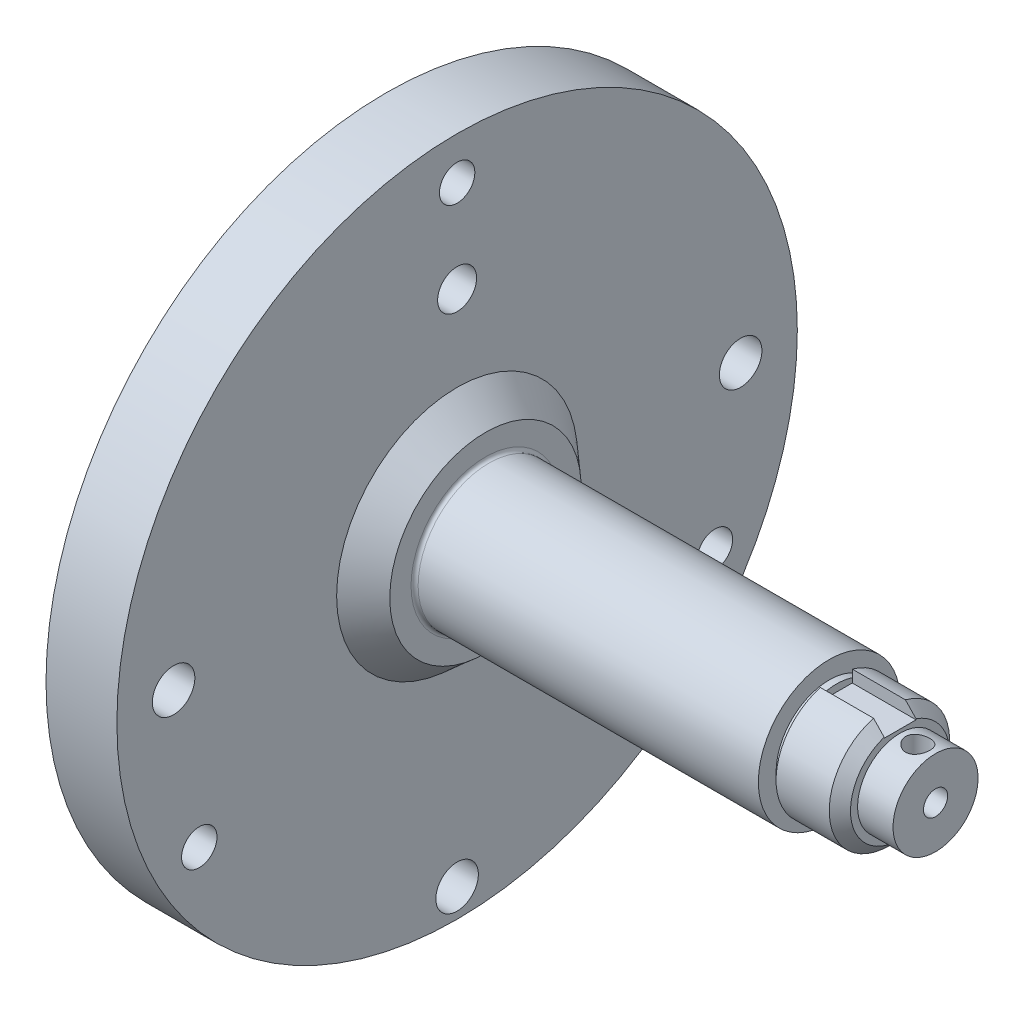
ISO-10303-21;
HEADER;
FILE_DESCRIPTION(('STEP AP214'),'2;1');
FILE_NAME('part.step','',(''),(''),'','','');
FILE_SCHEMA(('AUTOMOTIVE_DESIGN { 1 0 10303 214 1 1 1 1 }'));
ENDSEC;
DATA;
#1=APPLICATION_CONTEXT('core data for automotive mechanical design processes');
#2=APPLICATION_PROTOCOL_DEFINITION('international standard','automotive_design',2000,#1);
#3=PRODUCT_CONTEXT('',#1,'mechanical');
#4=PRODUCT('Part','Part','',(#3));
#5=PRODUCT_RELATED_PRODUCT_CATEGORY('part','',(#4));
#6=PRODUCT_DEFINITION_FORMATION('','',#4);
#7=PRODUCT_DEFINITION_CONTEXT('part definition',#1,'design');
#8=PRODUCT_DEFINITION('design','',#6,#7);
#9=PRODUCT_DEFINITION_SHAPE('','',#8);
#10=(LENGTH_UNIT() NAMED_UNIT(*) SI_UNIT(.MILLI.,.METRE.));
#11=(NAMED_UNIT(*) PLANE_ANGLE_UNIT() SI_UNIT($,.RADIAN.));
#12=(NAMED_UNIT(*) SI_UNIT($,.STERADIAN.) SOLID_ANGLE_UNIT());
#13=UNCERTAINTY_MEASURE_WITH_UNIT(LENGTH_MEASURE(1.E-05),#10,'distance_accuracy_value','');
#14=(GEOMETRIC_REPRESENTATION_CONTEXT(3) GLOBAL_UNCERTAINTY_ASSIGNED_CONTEXT((#13)) GLOBAL_UNIT_ASSIGNED_CONTEXT((#10,
#11,#12)) REPRESENTATION_CONTEXT('',''));
#15=CARTESIAN_POINT('',(0.,0.,0.));
#16=DIRECTION('',(0.,0.,1.));
#17=DIRECTION('',(1.,0.,0.));
#18=AXIS2_PLACEMENT_3D('',#15,#16,#17);
#19=CARTESIAN_POINT('',(0.,0.,0.));
#20=DIRECTION('',(-1.,0.,0.));
#21=DIRECTION('',(0.,0.,1.));
#22=AXIS2_PLACEMENT_3D('',#19,#20,#21);
#23=PLANE('',#22);
#24=CARTESIAN_POINT('',(0.,29.,0.));
#25=DIRECTION('',(-1.,0.,0.));
#26=DIRECTION('',(0.,0.,1.));
#27=AXIS2_PLACEMENT_3D('',#24,#25,#26);
#28=CIRCLE('',#27,2.75);
#29=CARTESIAN_POINT('',(0.,29.,2.75));
#30=VERTEX_POINT('',#29);
#31=EDGE_CURVE('E113',#30,#30,#28,.T.);
#32=ORIENTED_EDGE('',*,*,#31,.F.);
#33=EDGE_LOOP('',(#32));
#34=FACE_BOUND('',#33,.T.);
#35=CARTESIAN_POINT('',(0.,0.,0.));
#36=DIRECTION('',(-1.,0.,0.));
#37=DIRECTION('',(0.,0.,1.));
#38=AXIS2_PLACEMENT_3D('',#35,#36,#37);
#39=CIRCLE('',#38,35.);
#40=CARTESIAN_POINT('',(0.,0.,35.));
#41=VERTEX_POINT('',#40);
#42=EDGE_CURVE('E197',#41,#41,#39,.T.);
#43=ORIENTED_EDGE('',*,*,#42,.T.);
#44=EDGE_LOOP('',(#43));
#45=FACE_BOUND('',#44,.T.);
#46=ADVANCED_FACE('F33',(#34,#45),#23,.T.);
#47=CARTESIAN_POINT('',(-50.8434878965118,0.,0.));
#48=DIRECTION('',(-1.,0.,0.));
#49=DIRECTION('',(0.,0.,1.));
#50=AXIS2_PLACEMENT_3D('',#47,#48,#49);
#51=CYLINDRICAL_SURFACE('',#50,35.);
#52=CARTESIAN_POINT('',(-1.49999999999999,0.,0.));
#53=DIRECTION('',(-1.,0.,0.));
#54=DIRECTION('',(0.,0.,1.));
#55=AXIS2_PLACEMENT_3D('',#52,#53,#54);
#56=CIRCLE('',#55,35.);
#57=CARTESIAN_POINT('',(-1.49999999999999,0.,35.));
#58=VERTEX_POINT('',#57);
#59=EDGE_CURVE('E199',#58,#58,#56,.T.);
#60=ORIENTED_EDGE('',*,*,#59,.T.);
#61=EDGE_LOOP('',(#60));
#62=FACE_BOUND('',#61,.T.);
#63=ORIENTED_EDGE('',*,*,#42,.F.);
#64=EDGE_LOOP('',(#63));
#65=FACE_BOUND('',#64,.T.);
#66=ADVANCED_FACE('F186',(#62,#65),#51,.F.);
#67=CARTESIAN_POINT('',(-1.5,-48.,0.));
#68=DIRECTION('',(-1.,0.,0.));
#69=DIRECTION('',(0.,0.,1.));
#70=AXIS2_PLACEMENT_3D('',#67,#68,#69);
#71=PLANE('',#70);
#72=CARTESIAN_POINT('',(-1.5,42.,0.));
#73=DIRECTION('',(-1.,0.,0.));
#74=DIRECTION('',(0.,0.,1.));
#75=AXIS2_PLACEMENT_3D('',#72,#73,#74);
#76=CIRCLE('',#75,2.49999999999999);
#77=CARTESIAN_POINT('',(-1.5,42.,2.49999999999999));
#78=VERTEX_POINT('',#77);
#79=EDGE_CURVE('E165',#78,#78,#76,.T.);
#80=ORIENTED_EDGE('',*,*,#79,.F.);
#81=EDGE_LOOP('',(#80));
#82=FACE_BOUND('',#81,.T.);
#83=CARTESIAN_POINT('',(-1.5,-20.9999999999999,-36.3730669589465));
#84=DIRECTION('',(-1.,0.,0.));
#85=DIRECTION('',(0.,0.,1.));
#86=AXIS2_PLACEMENT_3D('',#83,#84,#85);
#87=CIRCLE('',#86,2.49999999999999);
#88=CARTESIAN_POINT('',(-1.5,-20.9999999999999,-33.8730669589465));
#89=VERTEX_POINT('',#88);
#90=EDGE_CURVE('E226',#89,#89,#87,.T.);
#91=ORIENTED_EDGE('',*,*,#90,.F.);
#92=EDGE_LOOP('',(#91));
#93=FACE_BOUND('',#92,.T.);
#94=CARTESIAN_POINT('',(-1.5,-20.9999999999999,36.3730669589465));
#95=DIRECTION('',(-1.,0.,0.));
#96=DIRECTION('',(0.,0.,1.));
#97=AXIS2_PLACEMENT_3D('',#94,#95,#96);
#98=CIRCLE('',#97,2.49999999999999);
#99=CARTESIAN_POINT('',(-1.5,-20.9999999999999,38.8730669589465));
#100=VERTEX_POINT('',#99);
#101=EDGE_CURVE('E222',#100,#100,#98,.T.);
#102=ORIENTED_EDGE('',*,*,#101,.F.);
#103=EDGE_LOOP('',(#102));
#104=FACE_BOUND('',#103,.T.);
#105=CARTESIAN_POINT('',(-1.5,-44.,0.));
#106=DIRECTION('',(-1.,0.,0.));
#107=DIRECTION('',(0.,0.,1.));
#108=AXIS2_PLACEMENT_3D('',#105,#106,#107);
#109=CIRCLE('',#108,3.);
#110=CARTESIAN_POINT('',(-1.5,-44.,3.));
#111=VERTEX_POINT('',#110);
#112=EDGE_CURVE('E218',#111,#111,#109,.T.);
#113=ORIENTED_EDGE('',*,*,#112,.F.);
#114=EDGE_LOOP('',(#113));
#115=FACE_BOUND('',#114,.T.);
#116=CARTESIAN_POINT('',(-1.5,0.,40.));
#117=DIRECTION('',(-1.,0.,0.));
#118=DIRECTION('',(0.,0.,1.));
#119=AXIS2_PLACEMENT_3D('',#116,#117,#118);
#120=CIRCLE('',#119,3.);
#121=CARTESIAN_POINT('',(-1.5,0.,43.));
#122=VERTEX_POINT('',#121);
#123=EDGE_CURVE('E214',#122,#122,#120,.T.);
#124=ORIENTED_EDGE('',*,*,#123,.F.);
#125=EDGE_LOOP('',(#124));
#126=FACE_BOUND('',#125,.T.);
#127=CARTESIAN_POINT('',(-1.5,0.,-40.));
#128=DIRECTION('',(-1.,0.,0.));
#129=DIRECTION('',(0.,0.,1.));
#130=AXIS2_PLACEMENT_3D('',#127,#128,#129);
#131=CIRCLE('',#130,3.);
#132=CARTESIAN_POINT('',(-1.5,0.,-37.));
#133=VERTEX_POINT('',#132);
#134=EDGE_CURVE('E210',#133,#133,#131,.T.);
#135=ORIENTED_EDGE('',*,*,#134,.F.);
#136=EDGE_LOOP('',(#135));
#137=FACE_BOUND('',#136,.T.);
#138=CARTESIAN_POINT('',(-1.5,0.,0.));
#139=DIRECTION('',(-1.,0.,0.));
#140=DIRECTION('',(0.,0.,1.));
#141=AXIS2_PLACEMENT_3D('',#138,#139,#140);
#142=CIRCLE('',#141,48.);
#143=CARTESIAN_POINT('',(-1.5,0.,48.));
#144=VERTEX_POINT('',#143);
#145=EDGE_CURVE('E202',#144,#144,#142,.T.);
#146=ORIENTED_EDGE('',*,*,#145,.T.);
#147=EDGE_LOOP('',(#146));
#148=FACE_BOUND('',#147,.T.);
#149=ORIENTED_EDGE('',*,*,#59,.F.);
#150=EDGE_LOOP('',(#149));
#151=FACE_BOUND('',#150,.T.);
#152=ADVANCED_FACE('F191',(#82,#93,#104,#115,#126,#137,#148,#151),#71,.T.);
#153=CARTESIAN_POINT('',(-50.8434878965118,0.,0.));
#154=DIRECTION('',(-1.,0.,0.));
#155=DIRECTION('',(0.,0.,1.));
#156=AXIS2_PLACEMENT_3D('',#153,#154,#155);
#157=CYLINDRICAL_SURFACE('',#156,48.);
#158=CARTESIAN_POINT('',(8.50000000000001,0.,0.));
#159=DIRECTION('',(-1.,0.,0.));
#160=DIRECTION('',(0.,0.,1.));
#161=AXIS2_PLACEMENT_3D('',#158,#159,#160);
#162=CIRCLE('',#161,48.);
#163=CARTESIAN_POINT('',(8.50000000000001,0.,48.));
#164=VERTEX_POINT('',#163);
#165=EDGE_CURVE('E259',#164,#164,#162,.T.);
#166=ORIENTED_EDGE('',*,*,#165,.T.);
#167=EDGE_LOOP('',(#166));
#168=FACE_BOUND('',#167,.T.);
#169=ORIENTED_EDGE('',*,*,#145,.F.);
#170=EDGE_LOOP('',(#169));
#171=FACE_BOUND('',#170,.T.);
#172=ADVANCED_FACE('F238',(#168,#171),#157,.T.);
#173=CARTESIAN_POINT('',(8.5,-17.,0.));
#174=DIRECTION('',(1.,0.,0.));
#175=DIRECTION('',(0.,0.,-1.));
#176=AXIS2_PLACEMENT_3D('',#173,#174,#175);
#177=PLANE('',#176);
#178=CARTESIAN_POINT('',(8.5,29.,0.));
#179=DIRECTION('',(1.,0.,0.));
#180=DIRECTION('',(0.,0.,-1.));
#181=AXIS2_PLACEMENT_3D('',#178,#179,#180);
#182=CIRCLE('',#181,2.75);
#183=CARTESIAN_POINT('',(8.5,29.,-2.75));
#184=VERTEX_POINT('',#183);
#185=EDGE_CURVE('E116',#184,#184,#182,.T.);
#186=ORIENTED_EDGE('',*,*,#185,.F.);
#187=EDGE_LOOP('',(#186));
#188=FACE_BOUND('',#187,.T.);
#189=CARTESIAN_POINT('',(8.5,42.,0.));
#190=DIRECTION('',(1.,0.,0.));
#191=DIRECTION('',(0.,0.,-1.));
#192=AXIS2_PLACEMENT_3D('',#189,#190,#191);
#193=CIRCLE('',#192,2.49999999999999);
#194=CARTESIAN_POINT('',(8.5,42.,-2.49999999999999));
#195=VERTEX_POINT('',#194);
#196=EDGE_CURVE('E227',#195,#195,#193,.T.);
#197=ORIENTED_EDGE('',*,*,#196,.F.);
#198=EDGE_LOOP('',(#197));
#199=FACE_BOUND('',#198,.T.);
#200=CARTESIAN_POINT('',(8.5,-20.9999999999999,-36.3730669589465));
#201=DIRECTION('',(1.,0.,0.));
#202=DIRECTION('',(0.,0.,-1.));
#203=AXIS2_PLACEMENT_3D('',#200,#201,#202);
#204=CIRCLE('',#203,2.49999999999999);
#205=CARTESIAN_POINT('',(8.5,-20.9999999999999,-38.8730669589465));
#206=VERTEX_POINT('',#205);
#207=EDGE_CURVE('E223',#206,#206,#204,.T.);
#208=ORIENTED_EDGE('',*,*,#207,.F.);
#209=EDGE_LOOP('',(#208));
#210=FACE_BOUND('',#209,.T.);
#211=CARTESIAN_POINT('',(8.5,-20.9999999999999,36.3730669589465));
#212=DIRECTION('',(1.,0.,0.));
#213=DIRECTION('',(0.,0.,-1.));
#214=AXIS2_PLACEMENT_3D('',#211,#212,#213);
#215=CIRCLE('',#214,2.49999999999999);
#216=CARTESIAN_POINT('',(8.5,-20.9999999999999,33.8730669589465));
#217=VERTEX_POINT('',#216);
#218=EDGE_CURVE('E219',#217,#217,#215,.T.);
#219=ORIENTED_EDGE('',*,*,#218,.F.);
#220=EDGE_LOOP('',(#219));
#221=FACE_BOUND('',#220,.T.);
#222=CARTESIAN_POINT('',(8.50000000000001,-44.,0.));
#223=DIRECTION('',(1.,0.,0.));
#224=DIRECTION('',(0.,0.,-1.));
#225=AXIS2_PLACEMENT_3D('',#222,#223,#224);
#226=CIRCLE('',#225,3.);
#227=CARTESIAN_POINT('',(8.50000000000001,-44.,-3.));
#228=VERTEX_POINT('',#227);
#229=EDGE_CURVE('E215',#228,#228,#226,.T.);
#230=ORIENTED_EDGE('',*,*,#229,.F.);
#231=EDGE_LOOP('',(#230));
#232=FACE_BOUND('',#231,.T.);
#233=CARTESIAN_POINT('',(8.50000000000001,0.,40.));
#234=DIRECTION('',(1.,0.,0.));
#235=DIRECTION('',(0.,0.,-1.));
#236=AXIS2_PLACEMENT_3D('',#233,#234,#235);
#237=CIRCLE('',#236,3.);
#238=CARTESIAN_POINT('',(8.50000000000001,0.,37.));
#239=VERTEX_POINT('',#238);
#240=EDGE_CURVE('E211',#239,#239,#237,.T.);
#241=ORIENTED_EDGE('',*,*,#240,.F.);
#242=EDGE_LOOP('',(#241));
#243=FACE_BOUND('',#242,.T.);
#244=CARTESIAN_POINT('',(8.50000000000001,0.,-40.));
#245=DIRECTION('',(1.,0.,0.));
#246=DIRECTION('',(0.,0.,-1.));
#247=AXIS2_PLACEMENT_3D('',#244,#245,#246);
#248=CIRCLE('',#247,3.);
#249=CARTESIAN_POINT('',(8.50000000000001,0.,-43.));
#250=VERTEX_POINT('',#249);
#251=EDGE_CURVE('E206',#250,#250,#248,.T.);
#252=ORIENTED_EDGE('',*,*,#251,.F.);
#253=EDGE_LOOP('',(#252));
#254=FACE_BOUND('',#253,.T.);
#255=CARTESIAN_POINT('',(8.5,0.,0.));
#256=DIRECTION('',(-1.,0.,0.));
#257=DIRECTION('',(0.,0.,1.));
#258=AXIS2_PLACEMENT_3D('',#255,#256,#257);
#259=CIRCLE('',#258,17.);
#260=CARTESIAN_POINT('',(8.5,0.,17.));
#261=VERTEX_POINT('',#260);
#262=EDGE_CURVE('E261',#261,#261,#259,.T.);
#263=ORIENTED_EDGE('',*,*,#262,.T.);
#264=EDGE_LOOP('',(#263));
#265=FACE_BOUND('',#264,.T.);
#266=ORIENTED_EDGE('',*,*,#165,.F.);
#267=EDGE_LOOP('',(#266));
#268=FACE_BOUND('',#267,.T.);
#269=ADVANCED_FACE('F454',(#188,#199,#210,#221,#232,#243,#254,#265,#268),#177,.T.);
#270=CARTESIAN_POINT('',(8.5,0.,0.));
#271=DIRECTION('',(-1.,0.,0.));
#272=DIRECTION('',(0.,0.,1.));
#273=AXIS2_PLACEMENT_3D('',#270,#271,#272);
#274=CONICAL_SURFACE('',#273,17.,0.718829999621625);
#275=CARTESIAN_POINT('',(12.5,0.,0.));
#276=DIRECTION('',(-1.,0.,0.));
#277=DIRECTION('',(0.,0.,1.));
#278=AXIS2_PLACEMENT_3D('',#275,#276,#277);
#279=CIRCLE('',#278,13.5);
#280=CARTESIAN_POINT('',(12.5,0.,13.5));
#281=VERTEX_POINT('',#280);
#282=EDGE_CURVE('E266',#281,#281,#279,.T.);
#283=ORIENTED_EDGE('',*,*,#282,.T.);
#284=EDGE_LOOP('',(#283));
#285=FACE_BOUND('',#284,.T.);
#286=ORIENTED_EDGE('',*,*,#262,.F.);
#287=EDGE_LOOP('',(#286));
#288=FACE_BOUND('',#287,.T.);
#289=ADVANCED_FACE('F459',(#285,#288),#274,.T.);
#290=CARTESIAN_POINT('',(12.5,-13.5,0.));
#291=DIRECTION('',(1.,0.,0.));
#292=DIRECTION('',(0.,0.,-1.));
#293=AXIS2_PLACEMENT_3D('',#290,#291,#292);
#294=PLANE('',#293);
#295=CARTESIAN_POINT('',(12.5,0.,0.));
#296=DIRECTION('',(-1.,0.,0.));
#297=DIRECTION('',(0.,0.,1.));
#298=AXIS2_PLACEMENT_3D('',#295,#296,#297);
#299=CIRCLE('',#298,10.5);
#300=CARTESIAN_POINT('',(12.5,0.,10.5));
#301=VERTEX_POINT('',#300);
#302=EDGE_CURVE('E269',#301,#301,#299,.T.);
#303=ORIENTED_EDGE('',*,*,#302,.T.);
#304=EDGE_LOOP('',(#303));
#305=FACE_BOUND('',#304,.T.);
#306=ORIENTED_EDGE('',*,*,#282,.F.);
#307=EDGE_LOOP('',(#306));
#308=FACE_BOUND('',#307,.T.);
#309=ADVANCED_FACE('F499',(#305,#308),#294,.T.);
#310=CARTESIAN_POINT('',(13.,0.,0.));
#311=DIRECTION('',(-1.,0.,0.));
#312=DIRECTION('',(0.,0.,1.));
#313=AXIS2_PLACEMENT_3D('',#310,#311,#312);
#314=TOROIDAL_SURFACE('',#313,10.5,0.5);
#315=CARTESIAN_POINT('',(13.,0.,0.));
#316=DIRECTION('',(-1.,0.,0.));
#317=DIRECTION('',(0.,0.,1.));
#318=AXIS2_PLACEMENT_3D('',#315,#316,#317);
#319=CIRCLE('',#318,10.);
#320=CARTESIAN_POINT('',(13.,0.,10.));
#321=VERTEX_POINT('',#320);
#322=EDGE_CURVE('E272',#321,#321,#319,.T.);
#323=ORIENTED_EDGE('',*,*,#322,.T.);
#324=EDGE_LOOP('',(#323));
#325=FACE_BOUND('',#324,.T.);
#326=ORIENTED_EDGE('',*,*,#302,.F.);
#327=EDGE_LOOP('',(#326));
#328=FACE_BOUND('',#327,.T.);
#329=ADVANCED_FACE('F503',(#325,#328),#314,.F.);
#330=CARTESIAN_POINT('',(-50.8434878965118,0.,0.));
#331=DIRECTION('',(-1.,0.,0.));
#332=DIRECTION('',(0.,0.,1.));
#333=AXIS2_PLACEMENT_3D('',#330,#331,#332);
#334=CYLINDRICAL_SURFACE('',#333,10.);
#335=CARTESIAN_POINT('',(61.,0.,0.));
#336=DIRECTION('',(-1.,0.,0.));
#337=DIRECTION('',(0.,0.,1.));
#338=AXIS2_PLACEMENT_3D('',#335,#336,#337);
#339=CIRCLE('',#338,9.99999999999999);
#340=CARTESIAN_POINT('',(61.,0.,9.99999999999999));
#341=VERTEX_POINT('',#340);
#342=EDGE_CURVE('E275',#341,#341,#339,.T.);
#343=ORIENTED_EDGE('',*,*,#342,.T.);
#344=EDGE_LOOP('',(#343));
#345=FACE_BOUND('',#344,.T.);
#346=ORIENTED_EDGE('',*,*,#322,.F.);
#347=EDGE_LOOP('',(#346));
#348=FACE_BOUND('',#347,.T.);
#349=ADVANCED_FACE('F507',(#345,#348),#334,.T.);
#350=CARTESIAN_POINT('',(61.,-7.5,0.));
#351=DIRECTION('',(1.,0.,0.));
#352=DIRECTION('',(0.,0.,-1.));
#353=AXIS2_PLACEMENT_3D('',#350,#351,#352);
#354=PLANE('',#353);
#355=CARTESIAN_POINT('',(61.,0.,0.));
#356=DIRECTION('',(-1.,0.,0.));
#357=DIRECTION('',(0.,0.,1.));
#358=AXIS2_PLACEMENT_3D('',#355,#356,#357);
#359=CIRCLE('',#358,7.5);
#360=CARTESIAN_POINT('',(61.,0.,7.5));
#361=VERTEX_POINT('',#360);
#362=EDGE_CURVE('E278',#361,#361,#359,.T.);
#363=ORIENTED_EDGE('',*,*,#362,.T.);
#364=EDGE_LOOP('',(#363));
#365=FACE_BOUND('',#364,.T.);
#366=ORIENTED_EDGE('',*,*,#342,.F.);
#367=EDGE_LOOP('',(#366));
#368=FACE_BOUND('',#367,.T.);
#369=ADVANCED_FACE('F386',(#365,#368),#354,.T.);
#370=CARTESIAN_POINT('',(-50.8434878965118,0.,0.));
#371=DIRECTION('',(-1.,0.,0.));
#372=DIRECTION('',(0.,0.,1.));
#373=AXIS2_PLACEMENT_3D('',#370,#371,#372);
#374=CYLINDRICAL_SURFACE('',#373,7.5);
#375=CARTESIAN_POINT('',(62.,0.,0.));
#376=DIRECTION('',(-1.,0.,0.));
#377=DIRECTION('',(0.,0.,1.));
#378=AXIS2_PLACEMENT_3D('',#375,#376,#377);
#379=CIRCLE('',#378,7.5);
#380=CARTESIAN_POINT('',(62.,7.15454401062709,2.25));
#381=VERTEX_POINT('',#380);
#382=CARTESIAN_POINT('',(62.,7.15454401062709,-2.25));
#383=VERTEX_POINT('',#382);
#384=EDGE_CURVE('E99',#381,#383,#379,.T.);
#385=ORIENTED_EDGE('',*,*,#384,.T.);
#386=EDGE_CURVE('E282',#383,#381,#379,.T.);
#387=ORIENTED_EDGE('',*,*,#386,.T.);
#388=EDGE_LOOP('',(#385,#387));
#389=FACE_BOUND('',#388,.T.);
#390=ORIENTED_EDGE('',*,*,#362,.F.);
#391=EDGE_LOOP('',(#390));
#392=FACE_BOUND('',#391,.T.);
#393=ADVANCED_FACE('F380',(#389,#392),#374,.T.);
#394=CARTESIAN_POINT('',(62.,-8.5,0.));
#395=DIRECTION('',(-1.,0.,0.));
#396=DIRECTION('',(0.,0.,1.));
#397=AXIS2_PLACEMENT_3D('',#394,#395,#396);
#398=PLANE('',#397);
#399=DIRECTION('',(0.,1.,0.));
#400=VECTOR('',#399,1.);
#401=CARTESIAN_POINT('',(62.,6.5,-2.25));
#402=LINE('',#401,#400);
#403=CARTESIAN_POINT('',(62.,8.19679815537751,-2.25));
#404=VERTEX_POINT('',#403);
#405=EDGE_CURVE('E125',#383,#404,#402,.T.);
#406=ORIENTED_EDGE('',*,*,#405,.T.);
#407=CARTESIAN_POINT('',(62.,0.,0.));
#408=DIRECTION('',(-1.,0.,0.));
#409=DIRECTION('',(0.,0.,1.));
#410=AXIS2_PLACEMENT_3D('',#407,#408,#409);
#411=CIRCLE('',#410,8.5);
#412=CARTESIAN_POINT('',(62.,8.1967981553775,2.25));
#413=VERTEX_POINT('',#412);
#414=EDGE_CURVE('E283',#404,#413,#411,.T.);
#415=ORIENTED_EDGE('',*,*,#414,.T.);
#416=DIRECTION('',(0.,1.,0.));
#417=VECTOR('',#416,1.);
#418=CARTESIAN_POINT('',(62.,6.5,2.25));
#419=LINE('',#418,#417);
#420=EDGE_CURVE('E103',#381,#413,#419,.T.);
#421=ORIENTED_EDGE('',*,*,#420,.F.);
#422=ORIENTED_EDGE('',*,*,#386,.F.);
#423=EDGE_LOOP('',(#406,#415,#421,#422));
#424=FACE_BOUND('',#423,.T.);
#425=ADVANCED_FACE('F385',(#424),#398,.T.);
#426=CARTESIAN_POINT('',(-50.8434878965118,0.,0.));
#427=DIRECTION('',(-1.,0.,0.));
#428=DIRECTION('',(0.,0.,1.));
#429=AXIS2_PLACEMENT_3D('',#426,#427,#428);
#430=CYLINDRICAL_SURFACE('',#429,8.5);
#431=DIRECTION('',(-1.,0.,0.));
#432=VECTOR('',#431,1.);
#433=CARTESIAN_POINT('',(-50.8434878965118,8.19679815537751,-2.24999999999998));
#434=LINE('',#433,#432);
#435=CARTESIAN_POINT('',(69.5,8.1967981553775,-2.25));
#436=VERTEX_POINT('',#435);
#437=EDGE_CURVE('E166',#436,#404,#434,.T.);
#438=ORIENTED_EDGE('',*,*,#437,.F.);
#439=CARTESIAN_POINT('',(69.5,0.,0.));
#440=DIRECTION('',(-1.,0.,0.));
#441=DIRECTION('',(0.,0.,1.));
#442=AXIS2_PLACEMENT_3D('',#439,#440,#441);
#443=CIRCLE('',#442,8.5);
#444=CARTESIAN_POINT('',(69.5,8.1967981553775,2.25));
#445=VERTEX_POINT('',#444);
#446=EDGE_CURVE('E286',#436,#445,#443,.T.);
#447=ORIENTED_EDGE('',*,*,#446,.T.);
#448=DIRECTION('',(-1.,0.,0.));
#449=VECTOR('',#448,1.);
#450=CARTESIAN_POINT('',(-50.8434878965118,8.1967981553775,2.25000000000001));
#451=LINE('',#450,#449);
#452=EDGE_CURVE('E135',#413,#445,#451,.F.);
#453=ORIENTED_EDGE('',*,*,#452,.F.);
#454=ORIENTED_EDGE('',*,*,#414,.F.);
#455=EDGE_LOOP('',(#438,#447,#453,#454));
#456=FACE_BOUND('',#455,.T.);
#457=ADVANCED_FACE('F181',(#456),#430,.T.);
#458=CARTESIAN_POINT('',(69.5,0.,0.));
#459=DIRECTION('',(-1.,0.,0.));
#460=DIRECTION('',(0.,0.,1.));
#461=AXIS2_PLACEMENT_3D('',#458,#459,#460);
#462=CONICAL_SURFACE('',#461,8.5,0.785398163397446);
#463=CARTESIAN_POINT('',(73.3834234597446,4.03116347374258,-2.25));
#464=CARTESIAN_POINT('',(73.2531466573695,4.18030913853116,-2.25));
#465=CARTESIAN_POINT('',(73.1219502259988,4.3286442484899,-2.25));
#466=CARTESIAN_POINT('',(72.858085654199,4.62399117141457,-2.25));
#467=CARTESIAN_POINT('',(72.7254175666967,4.77100303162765,-2.25));
#468=CARTESIAN_POINT('',(72.458980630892,5.06399785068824,-2.25));
#469=CARTESIAN_POINT('',(72.3252118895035,5.20998090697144,-2.25));
#470=CARTESIAN_POINT('',(72.0567876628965,5.50113175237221,-2.25));
#471=CARTESIAN_POINT('',(71.9221321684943,5.64629953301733,-2.25));
#472=CARTESIAN_POINT('',(71.5171568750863,6.08077479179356,-2.25));
#473=CARTESIAN_POINT('',(71.2457851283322,6.36910137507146,-2.25));
#474=CARTESIAN_POINT('',(70.7011624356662,6.94398552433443,-2.25));
#475=CARTESIAN_POINT('',(70.4279114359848,7.23054303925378,-2.25));
#476=CARTESIAN_POINT('',(69.8801307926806,7.80233887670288,-2.25));
#477=CARTESIAN_POINT('',(69.6056013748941,8.0875774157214,-2.25));
#478=CARTESIAN_POINT('',(69.0555772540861,8.65711507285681,-2.25));
#479=CARTESIAN_POINT('',(68.7800825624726,8.94141420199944,-2.25));
#480=CARTESIAN_POINT('',(68.2283260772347,9.5093457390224,-2.25));
#481=CARTESIAN_POINT('',(67.952064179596,9.79297804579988,-2.25));
#482=CARTESIAN_POINT('',(67.3989694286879,10.3596846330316,-2.25));
#483=CARTESIAN_POINT('',(67.1221365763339,10.6427589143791,-2.25));
#484=CARTESIAN_POINT('',(66.845096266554,10.9256293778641,-2.25));
#485=B_SPLINE_CURVE_WITH_KNOTS('',3,(#463,#464,#465,#466,#467,#468,#469,#470,#471,#472,#473,
#474,#475,#476,#477,#478,#479,#480,#481,#482,#483,#484),.UNSPECIFIED.,.F.,.F.,(4,2,2,2,2,2,2,2,
2,2,4),(0.,0.594082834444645,1.18814437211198,1.78214887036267,2.37615953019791,
3.56398905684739,4.75185271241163,5.93951393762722,7.12716117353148,8.31497816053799,
9.50279324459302),.UNSPECIFIED.);
#486=CARTESIAN_POINT('',(71.,6.62853679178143,-2.25));
#487=VERTEX_POINT('',#486);
#488=EDGE_CURVE('E606',#487,#436,#485,.T.);
#489=ORIENTED_EDGE('',*,*,#488,.F.);
#490=CARTESIAN_POINT('',(71.,0.,0.));
#491=DIRECTION('',(-1.,0.,0.));
#492=DIRECTION('',(0.,0.,1.));
#493=AXIS2_PLACEMENT_3D('',#490,#491,#492);
#494=CIRCLE('',#493,7.00000000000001);
#495=CARTESIAN_POINT('',(71.,6.62853679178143,2.25));
#496=VERTEX_POINT('',#495);
#497=EDGE_CURVE('E289',#487,#496,#494,.T.);
#498=ORIENTED_EDGE('',*,*,#497,.T.);
#499=CARTESIAN_POINT('',(66.845096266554,10.9256293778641,2.25));
#500=CARTESIAN_POINT('',(67.1221365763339,10.6427589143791,2.25));
#501=CARTESIAN_POINT('',(67.3989694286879,10.3596846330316,2.25));
#502=CARTESIAN_POINT('',(67.952064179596,9.79297804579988,2.25));
#503=CARTESIAN_POINT('',(68.2283260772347,9.5093457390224,2.25));
#504=CARTESIAN_POINT('',(68.7800825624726,8.94141420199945,2.25));
#505=CARTESIAN_POINT('',(69.0555772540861,8.65711507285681,2.25));
#506=CARTESIAN_POINT('',(69.6056013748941,8.08757741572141,2.25));
#507=CARTESIAN_POINT('',(69.8801307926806,7.80233887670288,2.25));
#508=CARTESIAN_POINT('',(70.4279114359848,7.23054303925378,2.25));
#509=CARTESIAN_POINT('',(70.7011624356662,6.94398552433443,2.25));
#510=CARTESIAN_POINT('',(71.2457851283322,6.36910137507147,2.25));
#511=CARTESIAN_POINT('',(71.5171568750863,6.08077479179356,2.25));
#512=CARTESIAN_POINT('',(71.9221321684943,5.64629953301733,2.25));
#513=CARTESIAN_POINT('',(72.0567876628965,5.50113175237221,2.25));
#514=CARTESIAN_POINT('',(72.3252118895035,5.20998090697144,2.25));
#515=CARTESIAN_POINT('',(72.458980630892,5.06399785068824,2.25));
#516=CARTESIAN_POINT('',(72.7254175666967,4.77100303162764,2.25));
#517=CARTESIAN_POINT('',(72.858085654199,4.62399117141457,2.25));
#518=CARTESIAN_POINT('',(73.1219502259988,4.3286442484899,2.25));
#519=CARTESIAN_POINT('',(73.2531466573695,4.18030913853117,2.25));
#520=CARTESIAN_POINT('',(73.3834234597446,4.03116347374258,2.25));
#521=B_SPLINE_CURVE_WITH_KNOTS('',3,(#499,#500,#501,#502,#503,#504,#505,#506,#507,#508,#509,
#510,#511,#512,#513,#514,#515,#516,#517,#518,#519,#520),.UNSPECIFIED.,.F.,.F.,(4,2,2,2,2,2,2,2,
2,2,4),(0.,1.18781508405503,2.37563207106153,3.5632793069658,4.75094053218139,5.93880418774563,
7.12663371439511,7.72064437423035,8.31464887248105,8.90871041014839,9.50279324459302),.UNSPECIFIED.);
#522=EDGE_CURVE('E124',#445,#496,#521,.T.);
#523=ORIENTED_EDGE('',*,*,#522,.F.);
#524=ORIENTED_EDGE('',*,*,#446,.F.);
#525=EDGE_LOOP('',(#489,#498,#523,#524));
#526=FACE_BOUND('',#525,.T.);
#527=ADVANCED_FACE('F137',(#526),#462,.T.);
#528=CARTESIAN_POINT('',(71.,-6.,0.));
#529=DIRECTION('',(1.,0.,0.));
#530=DIRECTION('',(0.,0.,-1.));
#531=AXIS2_PLACEMENT_3D('',#528,#529,#530);
#532=PLANE('',#531);
#533=DIRECTION('',(0.,1.,0.));
#534=VECTOR('',#533,1.);
#535=CARTESIAN_POINT('',(71.,6.5,-2.25));
#536=LINE('',#535,#534);
#537=CARTESIAN_POINT('',(71.,6.5,-2.25));
#538=VERTEX_POINT('',#537);
#539=EDGE_CURVE('E126',#538,#487,#536,.T.);
#540=ORIENTED_EDGE('',*,*,#539,.F.);
#541=DIRECTION('',(0.,0.,-1.));
#542=VECTOR('',#541,1.);
#543=CARTESIAN_POINT('',(71.,6.5,2.25));
#544=LINE('',#543,#542);
#545=CARTESIAN_POINT('',(71.,6.5,2.25));
#546=VERTEX_POINT('',#545);
#547=EDGE_CURVE('E108',#546,#538,#544,.T.);
#548=ORIENTED_EDGE('',*,*,#547,.F.);
#549=DIRECTION('',(0.,1.,0.));
#550=VECTOR('',#549,1.);
#551=CARTESIAN_POINT('',(71.,6.5,2.25));
#552=LINE('',#551,#550);
#553=EDGE_CURVE('E102',#546,#496,#552,.T.);
#554=ORIENTED_EDGE('',*,*,#553,.T.);
#555=ORIENTED_EDGE('',*,*,#497,.F.);
#556=EDGE_LOOP('',(#540,#548,#554,#555));
#557=FACE_BOUND('',#556,.T.);
#558=CARTESIAN_POINT('',(71.,0.,0.));
#559=DIRECTION('',(-1.,0.,0.));
#560=DIRECTION('',(0.,0.,1.));
#561=AXIS2_PLACEMENT_3D('',#558,#559,#560);
#562=CIRCLE('',#561,6.);
#563=CARTESIAN_POINT('',(71.,0.,6.));
#564=VERTEX_POINT('',#563);
#565=EDGE_CURVE('E292',#564,#564,#562,.T.);
#566=ORIENTED_EDGE('',*,*,#565,.T.);
#567=EDGE_LOOP('',(#566));
#568=FACE_BOUND('',#567,.T.);
#569=ADVANCED_FACE('F173',(#557,#568),#532,.T.);
#570=CARTESIAN_POINT('',(-50.8434878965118,0.,0.));
#571=DIRECTION('',(-1.,0.,0.));
#572=DIRECTION('',(0.,0.,1.));
#573=AXIS2_PLACEMENT_3D('',#570,#571,#572);
#574=CYLINDRICAL_SURFACE('',#573,6.);
#575=CARTESIAN_POINT('',(73.5,5.75412895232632,1.69999999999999));
#576=CARTESIAN_POINT('',(73.5934093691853,5.75413030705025,1.69999823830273));
#577=CARTESIAN_POINT('',(73.6868366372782,5.75642836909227,1.6922749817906));
#578=CARTESIAN_POINT('',(73.8709768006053,5.76534041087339,1.66165467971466));
#579=CARTESIAN_POINT('',(73.9616885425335,5.7719561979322,1.63875127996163));
#580=CARTESIAN_POINT('',(74.1377064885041,5.7886955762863,1.5785970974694));
#581=CARTESIAN_POINT('',(74.2230207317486,5.79881379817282,1.54136826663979));
#582=CARTESIAN_POINT('',(74.3862097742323,5.82141093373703,1.45369052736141));
#583=CARTESIAN_POINT('',(74.4640837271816,5.83389011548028,1.40324011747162));
#584=CARTESIAN_POINT('',(74.6123797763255,5.8601980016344,1.28902748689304));
#585=CARTESIAN_POINT('',(74.6825607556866,5.87405303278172,1.2249581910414));
#586=CARTESIAN_POINT('',(74.8113394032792,5.90132543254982,1.08598577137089));
#587=CARTESIAN_POINT('',(74.8699357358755,5.91474275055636,1.01108140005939));
#588=CARTESIAN_POINT('',(74.9749073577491,5.93992430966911,0.850872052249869));
#589=CARTESIAN_POINT('',(75.0210399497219,5.95165389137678,0.765402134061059));
#590=CARTESIAN_POINT('',(75.0981866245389,5.97183445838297,0.587530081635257));
#591=CARTESIAN_POINT('',(75.1292035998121,5.98028607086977,0.495129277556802));
#592=CARTESIAN_POINT('',(75.1744496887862,5.9927722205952,0.308538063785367));
#593=CARTESIAN_POINT('',(75.1890896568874,5.99691466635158,0.214454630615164));
#594=CARTESIAN_POINT('',(75.2024619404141,6.00069435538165,0.0250819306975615));
#595=CARTESIAN_POINT('',(75.2011972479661,6.00033244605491,-0.0702071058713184));
#596=CARTESIAN_POINT('',(75.1830788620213,5.99522191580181,-0.256415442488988));
#597=CARTESIAN_POINT('',(75.1666695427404,5.990598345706,-0.347381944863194));
#598=CARTESIAN_POINT('',(75.1194494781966,5.97763369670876,-0.525212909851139));
#599=CARTESIAN_POINT('',(75.0886378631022,5.96929239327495,-0.612077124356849));
#600=CARTESIAN_POINT('',(75.0131668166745,5.94965018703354,-0.780334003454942));
#601=CARTESIAN_POINT('',(74.9683612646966,5.93831826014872,-0.861657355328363));
#602=CARTESIAN_POINT('',(74.8662879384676,5.91390668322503,-1.01577810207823));
#603=CARTESIAN_POINT('',(74.8090174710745,5.90082665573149,-1.08857364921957));
#604=CARTESIAN_POINT('',(74.6813069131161,5.87379484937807,-1.22622537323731));
#605=CARTESIAN_POINT('',(74.610480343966,5.85982856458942,-1.290720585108));
#606=CARTESIAN_POINT('',(74.4588755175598,5.83299973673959,-1.40701296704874));
#607=CARTESIAN_POINT('',(74.3780964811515,5.8201372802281,-1.45880914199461));
#608=CARTESIAN_POINT('',(74.2080162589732,5.79690853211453,-1.54855629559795));
#609=CARTESIAN_POINT('',(74.1186539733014,5.78656232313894,-1.58639705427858));
#610=CARTESIAN_POINT('',(73.9344672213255,5.7697807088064,-1.64639365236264));
#611=CARTESIAN_POINT('',(73.8396443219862,5.76334418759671,-1.66855396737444));
#612=CARTESIAN_POINT('',(73.6506332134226,5.7553519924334,-1.69591307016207));
#613=CARTESIAN_POINT('',(73.5565302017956,5.75363999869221,-1.70165532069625));
#614=CARTESIAN_POINT('',(73.3687060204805,5.75486075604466,-1.69752257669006));
#615=CARTESIAN_POINT('',(73.2749848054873,5.75779293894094,-1.68764949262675));
#616=CARTESIAN_POINT('',(73.0927613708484,5.76781946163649,-1.65304794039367));
#617=CARTESIAN_POINT('',(73.0041892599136,5.77481905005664,-1.62865735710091));
#618=CARTESIAN_POINT('',(72.8323963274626,5.79209640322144,-1.56609880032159));
#619=CARTESIAN_POINT('',(72.7491762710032,5.80237463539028,-1.52792886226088));
#620=CARTESIAN_POINT('',(72.5882068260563,5.82536335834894,-1.43782736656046));
#621=CARTESIAN_POINT('',(72.5106404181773,5.838127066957,-1.38558281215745));
#622=CARTESIAN_POINT('',(72.365176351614,5.86452880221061,-1.26919507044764));
#623=CARTESIAN_POINT('',(72.2972807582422,5.87816701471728,-1.20504934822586));
#624=CARTESIAN_POINT('',(72.17077110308,5.90532808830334,-1.06414609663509));
#625=CARTESIAN_POINT('',(72.1125391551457,5.91883215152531,-0.987041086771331));
#626=CARTESIAN_POINT('',(72.0098385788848,5.94374387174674,-0.823839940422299));
#627=CARTESIAN_POINT('',(71.9653692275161,5.95515163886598,-0.737744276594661));
#628=CARTESIAN_POINT('',(71.8918792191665,5.9745125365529,-0.559604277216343));
#629=CARTESIAN_POINT('',(71.8627416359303,5.98249172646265,-0.467611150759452));
#630=CARTESIAN_POINT('',(71.8204194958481,5.99421149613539,-0.279770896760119));
#631=CARTESIAN_POINT('',(71.8072309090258,5.99795314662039,-0.183924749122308));
#632=CARTESIAN_POINT('',(71.7974602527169,6.0007185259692,0.00535045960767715));
#633=CARTESIAN_POINT('',(71.8003209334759,5.9999005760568,0.098748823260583));
#634=CARTESIAN_POINT('',(71.8212551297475,5.99400405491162,0.283679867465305));
#635=CARTESIAN_POINT('',(71.8393279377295,5.98892568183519,0.375212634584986));
#636=CARTESIAN_POINT('',(71.8898428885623,5.97511725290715,0.553053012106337));
#637=CARTESIAN_POINT('',(71.922159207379,5.96641920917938,0.639399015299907));
#638=CARTESIAN_POINT('',(72.0001319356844,5.94627535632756,0.805491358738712));
#639=CARTESIAN_POINT('',(72.0457903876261,5.93482912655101,0.88523668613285));
#640=CARTESIAN_POINT('',(72.1507100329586,5.90998442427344,1.03840499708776));
#641=CARTESIAN_POINT('',(72.2103311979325,5.8965385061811,1.1115736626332));
#642=CARTESIAN_POINT('',(72.3408180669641,5.86938134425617,1.24705519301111));
#643=CARTESIAN_POINT('',(72.4116868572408,5.85567002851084,1.3093650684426));
#644=CARTESIAN_POINT('',(72.5648466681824,5.82912408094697,1.42295797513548));
#645=CARTESIAN_POINT('',(72.6473844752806,5.81632104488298,1.47391638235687));
#646=CARTESIAN_POINT('',(72.8202080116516,5.79351413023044,1.56116635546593));
#647=CARTESIAN_POINT('',(72.9104892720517,5.78350865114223,1.59746631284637));
#648=CARTESIAN_POINT('',(73.0835233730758,5.76862765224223,1.6503273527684));
#649=CARTESIAN_POINT('',(73.1656202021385,5.7632381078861,1.66890730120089));
#650=CARTESIAN_POINT('',(73.3318067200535,5.75598841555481,1.69374348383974));
#651=CARTESIAN_POINT('',(73.4158961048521,5.75412773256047,1.70000158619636));
#652=CARTESIAN_POINT('',(73.5,5.75412895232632,1.69999999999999));
#653=B_SPLINE_CURVE_WITH_KNOTS('',3,(#575,#576,#577,#578,#579,#580,#581,#582,#583,#584,#585,
#586,#587,#588,#589,#590,#591,#592,#593,#594,#595,#596,#597,#598,#599,#600,#601,#602,#603,#604,
#605,#606,#607,#608,#609,#610,#611,#612,#613,#614,#615,#616,#617,#618,#619,#620,#621,#622,#623,
#624,#625,#626,#627,#628,#629,#630,#631,#632,#633,#634,#635,#636,#637,#638,#639,#640,#641,#642,
#643,#644,#645,#646,#647,#648,#649,#650,#651,#652),.UNSPECIFIED.,.T.,.F.,(4,2,2,2,2,2,2,2,2,2,2,
2,2,2,2,2,2,2,2,2,2,2,2,2,2,2,2,2,2,2,2,2,2,2,2,2,2,2,4),(0.,0.279918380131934,
0.559954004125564,0.839562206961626,1.11920217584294,1.40598414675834,1.69279916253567,
1.98485148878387,2.27684790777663,2.56134207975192,2.84578273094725,3.12213388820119,
3.39850173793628,3.67785767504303,3.95727402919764,4.24633912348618,4.53542686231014,
4.82675125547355,5.11799246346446,5.39947481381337,5.68092272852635,5.95606307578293,
6.23124266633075,6.51313520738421,6.79508785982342,7.08638354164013,7.37766391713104,
7.6666894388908,7.95564191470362,8.23462511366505,8.51359533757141,8.79014910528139,
9.06674523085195,9.35146103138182,9.63625509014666,9.92836993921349,10.2203173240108,
10.4723883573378,10.7244211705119),.UNSPECIFIED.);
#654=CARTESIAN_POINT('',(73.5,5.75412895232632,1.69999999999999));
#655=VERTEX_POINT('',#654);
#656=EDGE_CURVE('E158',#655,#655,#653,.T.);
#657=ORIENTED_EDGE('',*,*,#656,.F.);
#658=EDGE_LOOP('',(#657));
#659=FACE_BOUND('',#658,.T.);
#660=CARTESIAN_POINT('',(76.,0.,0.));
#661=DIRECTION('',(-1.,0.,0.));
#662=DIRECTION('',(0.,0.,1.));
#663=AXIS2_PLACEMENT_3D('',#660,#661,#662);
#664=CIRCLE('',#663,6.);
#665=CARTESIAN_POINT('',(76.,0.,6.));
#666=VERTEX_POINT('',#665);
#667=EDGE_CURVE('E295',#666,#666,#664,.T.);
#668=ORIENTED_EDGE('',*,*,#667,.T.);
#669=EDGE_LOOP('',(#668));
#670=FACE_BOUND('',#669,.T.);
#671=ORIENTED_EDGE('',*,*,#565,.F.);
#672=EDGE_LOOP('',(#671));
#673=FACE_BOUND('',#672,.T.);
#674=ADVANCED_FACE('F168',(#659,#670,#673),#574,.T.);
#675=CARTESIAN_POINT('',(76.,0.,0.));
#676=DIRECTION('',(1.,0.,0.));
#677=DIRECTION('',(0.,0.,-1.));
#678=AXIS2_PLACEMENT_3D('',#675,#676,#677);
#679=PLANE('',#678);
#680=CARTESIAN_POINT('',(76.,0.,0.));
#681=DIRECTION('',(1.,0.,0.));
#682=DIRECTION('',(0.,0.,-1.));
#683=AXIS2_PLACEMENT_3D('',#680,#681,#682);
#684=CIRCLE('',#683,1.69999999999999);
#685=CARTESIAN_POINT('',(76.,0.,-1.69999999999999));
#686=VERTEX_POINT('',#685);
#687=EDGE_CURVE('E298',#686,#686,#684,.T.);
#688=ORIENTED_EDGE('',*,*,#687,.F.);
#689=EDGE_LOOP('',(#688));
#690=FACE_BOUND('',#689,.T.);
#691=ORIENTED_EDGE('',*,*,#667,.F.);
#692=EDGE_LOOP('',(#691));
#693=FACE_BOUND('',#692,.T.);
#694=ADVANCED_FACE('F172',(#690,#693),#679,.T.);
#695=CARTESIAN_POINT('',(76.,0.,0.));
#696=DIRECTION('',(1.,0.,0.));
#697=DIRECTION('',(0.,0.,-1.));
#698=AXIS2_PLACEMENT_3D('',#695,#696,#697);
#699=CYLINDRICAL_SURFACE('',#698,1.69999999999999);
#700=CARTESIAN_POINT('',(73.5,0.,0.));
#701=DIRECTION('',(0.707106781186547,-0.707106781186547,0.));
#702=DIRECTION('',(0.707106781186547,0.707106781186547,0.));
#703=AXIS2_PLACEMENT_3D('',#700,#701,#702);
#704=ELLIPSE('',#703,2.40416305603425,1.69999999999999);
#705=CARTESIAN_POINT('',(73.5,0.,1.69999999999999));
#706=VERTEX_POINT('',#705);
#707=CARTESIAN_POINT('',(73.5,0.,-1.69999999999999));
#708=VERTEX_POINT('',#707);
#709=EDGE_CURVE('E40',#706,#708,#704,.F.);
#710=ORIENTED_EDGE('',*,*,#709,.T.);
#711=CARTESIAN_POINT('',(73.5,0.,0.));
#712=DIRECTION('',(0.707106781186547,0.707106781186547,0.));
#713=DIRECTION('',(0.707106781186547,-0.707106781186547,0.));
#714=AXIS2_PLACEMENT_3D('',#711,#712,#713);
#715=ELLIPSE('',#714,2.40416305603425,1.69999999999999);
#716=EDGE_CURVE('E11',#708,#706,#715,.T.);
#717=ORIENTED_EDGE('',*,*,#716,.T.);
#718=EDGE_LOOP('',(#710,#717));
#719=FACE_BOUND('',#718,.T.);
#720=CARTESIAN_POINT('',(62.,0.,0.));
#721=DIRECTION('',(1.,0.,0.));
#722=DIRECTION('',(0.,0.,-1.));
#723=AXIS2_PLACEMENT_3D('',#720,#721,#722);
#724=CIRCLE('',#723,1.69999999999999);
#725=CARTESIAN_POINT('',(62.,0.,-1.69999999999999));
#726=VERTEX_POINT('',#725);
#727=EDGE_CURVE('E209',#726,#726,#724,.T.);
#728=ORIENTED_EDGE('',*,*,#727,.F.);
#729=EDGE_LOOP('',(#728));
#730=FACE_BOUND('',#729,.T.);
#731=ORIENTED_EDGE('',*,*,#687,.T.);
#732=EDGE_LOOP('',(#731));
#733=FACE_BOUND('',#732,.T.);
#734=ADVANCED_FACE('F331',(#719,#730,#733),#699,.F.);
#735=CARTESIAN_POINT('',(62.,0.,0.));
#736=DIRECTION('',(1.,0.,0.));
#737=DIRECTION('',(0.,0.,-1.));
#738=AXIS2_PLACEMENT_3D('',#735,#736,#737);
#739=CONICAL_SURFACE('',#738,1.69999999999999,1.0471975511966);
#740=CARTESIAN_POINT('',(61.0185045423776,0.,0.));
#741=VERTEX_POINT('',#740);
#742=VERTEX_LOOP('',#741);
#743=FACE_BOUND('',#742,.T.);
#744=ORIENTED_EDGE('',*,*,#727,.T.);
#745=EDGE_LOOP('',(#744));
#746=FACE_BOUND('',#745,.T.);
#747=ADVANCED_FACE('F328',(#743,#746),#739,.F.);
#748=CARTESIAN_POINT('',(76.,0.,-40.));
#749=DIRECTION('',(-1.,0.,0.));
#750=DIRECTION('',(0.,0.,1.));
#751=AXIS2_PLACEMENT_3D('',#748,#749,#750);
#752=CYLINDRICAL_SURFACE('',#751,3.);
#753=ORIENTED_EDGE('',*,*,#251,.T.);
#754=EDGE_LOOP('',(#753));
#755=FACE_BOUND('',#754,.T.);
#756=ORIENTED_EDGE('',*,*,#134,.T.);
#757=EDGE_LOOP('',(#756));
#758=FACE_BOUND('',#757,.T.);
#759=ADVANCED_FACE('F324',(#755,#758),#752,.F.);
#760=CARTESIAN_POINT('',(76.,0.,40.));
#761=DIRECTION('',(-1.,0.,0.));
#762=DIRECTION('',(0.,0.,1.));
#763=AXIS2_PLACEMENT_3D('',#760,#761,#762);
#764=CYLINDRICAL_SURFACE('',#763,3.);
#765=ORIENTED_EDGE('',*,*,#240,.T.);
#766=EDGE_LOOP('',(#765));
#767=FACE_BOUND('',#766,.T.);
#768=ORIENTED_EDGE('',*,*,#123,.T.);
#769=EDGE_LOOP('',(#768));
#770=FACE_BOUND('',#769,.T.);
#771=ADVANCED_FACE('F318',(#767,#770),#764,.F.);
#772=CARTESIAN_POINT('',(76.,-44.,0.));
#773=DIRECTION('',(-1.,0.,0.));
#774=DIRECTION('',(0.,0.,1.));
#775=AXIS2_PLACEMENT_3D('',#772,#773,#774);
#776=CYLINDRICAL_SURFACE('',#775,3.);
#777=ORIENTED_EDGE('',*,*,#229,.T.);
#778=EDGE_LOOP('',(#777));
#779=FACE_BOUND('',#778,.T.);
#780=ORIENTED_EDGE('',*,*,#112,.T.);
#781=EDGE_LOOP('',(#780));
#782=FACE_BOUND('',#781,.T.);
#783=ADVANCED_FACE('F310',(#779,#782),#776,.F.);
#784=CARTESIAN_POINT('',(-1.5,-20.9999999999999,36.3730669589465));
#785=DIRECTION('',(-1.,0.,0.));
#786=DIRECTION('',(0.,0.,1.));
#787=AXIS2_PLACEMENT_3D('',#784,#785,#786);
#788=CYLINDRICAL_SURFACE('',#787,2.49999999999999);
#789=ORIENTED_EDGE('',*,*,#218,.T.);
#790=EDGE_LOOP('',(#789));
#791=FACE_BOUND('',#790,.T.);
#792=ORIENTED_EDGE('',*,*,#101,.T.);
#793=EDGE_LOOP('',(#792));
#794=FACE_BOUND('',#793,.T.);
#795=ADVANCED_FACE('F307',(#791,#794),#788,.F.);
#796=CARTESIAN_POINT('',(-1.5,-20.9999999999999,-36.3730669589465));
#797=DIRECTION('',(-1.,0.,0.));
#798=DIRECTION('',(0.,0.,1.));
#799=AXIS2_PLACEMENT_3D('',#796,#797,#798);
#800=CYLINDRICAL_SURFACE('',#799,2.49999999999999);
#801=ORIENTED_EDGE('',*,*,#207,.T.);
#802=EDGE_LOOP('',(#801));
#803=FACE_BOUND('',#802,.T.);
#804=ORIENTED_EDGE('',*,*,#90,.T.);
#805=EDGE_LOOP('',(#804));
#806=FACE_BOUND('',#805,.T.);
#807=ADVANCED_FACE('F309',(#803,#806),#800,.F.);
#808=CARTESIAN_POINT('',(-1.5,42.,0.));
#809=DIRECTION('',(-1.,0.,0.));
#810=DIRECTION('',(0.,0.,1.));
#811=AXIS2_PLACEMENT_3D('',#808,#809,#810);
#812=CYLINDRICAL_SURFACE('',#811,2.49999999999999);
#813=ORIENTED_EDGE('',*,*,#196,.T.);
#814=EDGE_LOOP('',(#813));
#815=FACE_BOUND('',#814,.T.);
#816=ORIENTED_EDGE('',*,*,#79,.T.);
#817=EDGE_LOOP('',(#816));
#818=FACE_BOUND('',#817,.T.);
#819=ADVANCED_FACE('F154',(#815,#818),#812,.F.);
#820=CARTESIAN_POINT('',(73.5,6.,0.));
#821=DIRECTION('',(0.,1.,0.));
#822=DIRECTION('',(0.,0.,1.));
#823=AXIS2_PLACEMENT_3D('',#820,#821,#822);
#824=CYLINDRICAL_SURFACE('',#823,1.69999999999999);
#825=ORIENTED_EDGE('',*,*,#656,.T.);
#826=EDGE_LOOP('',(#825));
#827=FACE_BOUND('',#826,.T.);
#828=ORIENTED_EDGE('',*,*,#709,.F.);
#829=ORIENTED_EDGE('',*,*,#716,.F.);
#830=EDGE_LOOP('',(#828,#829));
#831=FACE_BOUND('',#830,.T.);
#832=ADVANCED_FACE('F150',(#827,#831),#824,.F.);
#833=CARTESIAN_POINT('',(62.,6.5,2.25));
#834=DIRECTION('',(-1.,0.,0.));
#835=DIRECTION('',(0.,0.,1.));
#836=AXIS2_PLACEMENT_3D('',#833,#834,#835);
#837=PLANE('',#836);
#838=ORIENTED_EDGE('',*,*,#384,.F.);
#839=CARTESIAN_POINT('',(62.,6.5,2.25));
#840=VERTEX_POINT('',#839);
#841=EDGE_CURVE('E93',#840,#381,#419,.T.);
#842=ORIENTED_EDGE('',*,*,#841,.F.);
#843=DIRECTION('',(0.,0.,1.));
#844=VECTOR('',#843,1.);
#845=CARTESIAN_POINT('',(62.,6.5,2.25));
#846=LINE('',#845,#844);
#847=CARTESIAN_POINT('',(62.,6.5,-2.25));
#848=VERTEX_POINT('',#847);
#849=EDGE_CURVE('E96',#848,#840,#846,.T.);
#850=ORIENTED_EDGE('',*,*,#849,.F.);
#851=EDGE_CURVE('E122',#848,#383,#402,.T.);
#852=ORIENTED_EDGE('',*,*,#851,.T.);
#853=EDGE_LOOP('',(#838,#842,#850,#852));
#854=FACE_BOUND('',#853,.T.);
#855=ADVANCED_FACE('F94',(#854),#837,.F.);
#856=CARTESIAN_POINT('',(62.,6.5,-2.25));
#857=DIRECTION('',(0.,0.,-1.));
#858=DIRECTION('',(-1.,0.,0.));
#859=AXIS2_PLACEMENT_3D('',#856,#857,#858);
#860=PLANE('',#859);
#861=ORIENTED_EDGE('',*,*,#437,.T.);
#862=ORIENTED_EDGE('',*,*,#405,.F.);
#863=ORIENTED_EDGE('',*,*,#851,.F.);
#864=DIRECTION('',(-1.,0.,0.));
#865=VECTOR('',#864,1.);
#866=CARTESIAN_POINT('',(62.,6.5,-2.25));
#867=LINE('',#866,#865);
#868=EDGE_CURVE('E112',#538,#848,#867,.T.);
#869=ORIENTED_EDGE('',*,*,#868,.F.);
#870=ORIENTED_EDGE('',*,*,#539,.T.);
#871=ORIENTED_EDGE('',*,*,#488,.T.);
#872=EDGE_LOOP('',(#861,#862,#863,#869,#870,#871));
#873=FACE_BOUND('',#872,.T.);
#874=ADVANCED_FACE('F145',(#873),#860,.F.);
#875=CARTESIAN_POINT('',(62.,6.5,2.25));
#876=DIRECTION('',(0.,0.,1.));
#877=DIRECTION('',(1.,0.,0.));
#878=AXIS2_PLACEMENT_3D('',#875,#876,#877);
#879=PLANE('',#878);
#880=ORIENTED_EDGE('',*,*,#452,.T.);
#881=ORIENTED_EDGE('',*,*,#522,.T.);
#882=ORIENTED_EDGE('',*,*,#553,.F.);
#883=DIRECTION('',(1.,0.,0.));
#884=VECTOR('',#883,1.);
#885=CARTESIAN_POINT('',(62.,6.5,2.25));
#886=LINE('',#885,#884);
#887=EDGE_CURVE('E47',#840,#546,#886,.T.);
#888=ORIENTED_EDGE('',*,*,#887,.F.);
#889=ORIENTED_EDGE('',*,*,#841,.T.);
#890=ORIENTED_EDGE('',*,*,#420,.T.);
#891=EDGE_LOOP('',(#880,#881,#882,#888,#889,#890));
#892=FACE_BOUND('',#891,.T.);
#893=ADVANCED_FACE('F105',(#892),#879,.F.);
#894=CARTESIAN_POINT('',(62.,6.5,2.25));
#895=DIRECTION('',(0.,-1.,0.));
#896=DIRECTION('',(0.,0.,-1.));
#897=AXIS2_PLACEMENT_3D('',#894,#895,#896);
#898=PLANE('',#897);
#899=ORIENTED_EDGE('',*,*,#849,.T.);
#900=ORIENTED_EDGE('',*,*,#887,.T.);
#901=ORIENTED_EDGE('',*,*,#547,.T.);
#902=ORIENTED_EDGE('',*,*,#868,.T.);
#903=EDGE_LOOP('',(#899,#900,#901,#902));
#904=FACE_BOUND('',#903,.T.);
#905=ADVANCED_FACE('F110',(#904),#898,.F.);
#906=CARTESIAN_POINT('',(8.5,29.,0.));
#907=DIRECTION('',(1.,0.,0.));
#908=DIRECTION('',(0.,0.,-1.));
#909=AXIS2_PLACEMENT_3D('',#906,#907,#908);
#910=CYLINDRICAL_SURFACE('',#909,2.75);
#911=ORIENTED_EDGE('',*,*,#31,.T.);
#912=EDGE_LOOP('',(#911));
#913=FACE_BOUND('',#912,.T.);
#914=ORIENTED_EDGE('',*,*,#185,.T.);
#915=EDGE_LOOP('',(#914));
#916=FACE_BOUND('',#915,.T.);
#917=ADVANCED_FACE('F442',(#913,#916),#910,.F.);
#918=CLOSED_SHELL('',(#46,#66,#152,#172,#269,#289,#309,#329,#349,#369,#393,#425,#457,#527,#569,
#674,#694,#734,#747,#759,#771,#783,#795,#807,#819,#832,#855,#874,#893,#905,#917));
#919=MANIFOLD_SOLID_BREP('B2',#918);
#920=ADVANCED_BREP_SHAPE_REPRESENTATION('',(#18,#919),#14);
#921=SHAPE_DEFINITION_REPRESENTATION(#9,#920);
ENDSEC;
END-ISO-10303-21;
